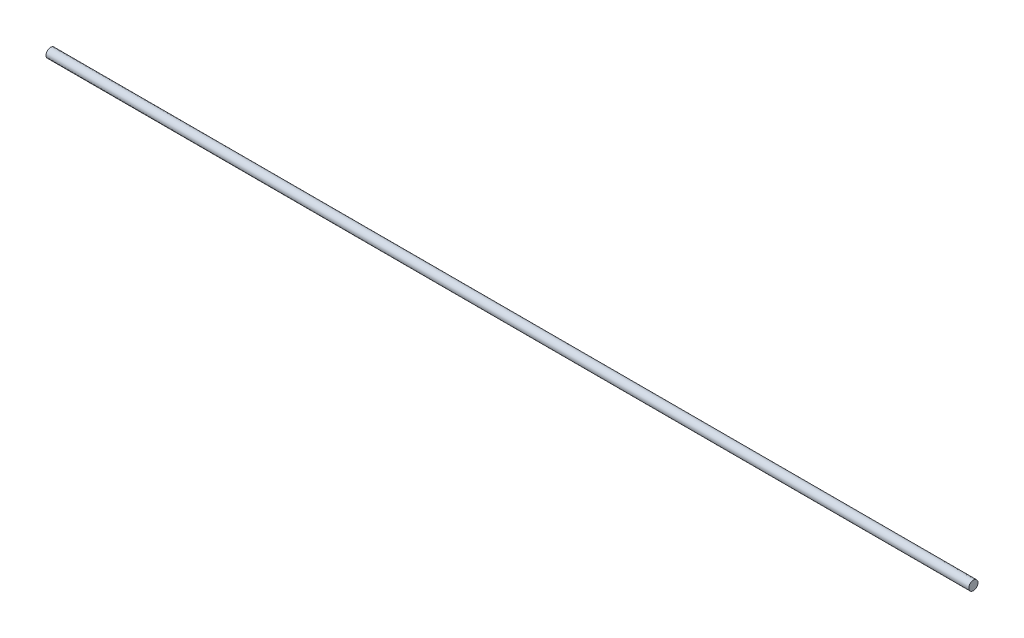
ISO-10303-21;
HEADER;
FILE_DESCRIPTION(('STEP AP214'),'2;1');
FILE_NAME('part.step','',(''),(''),'','','');
FILE_SCHEMA(('AUTOMOTIVE_DESIGN { 1 0 10303 214 1 1 1 1 }'));
ENDSEC;
DATA;
#1=APPLICATION_CONTEXT('core data for automotive mechanical design processes');
#2=APPLICATION_PROTOCOL_DEFINITION('international standard','automotive_design',2000,#1);
#3=PRODUCT_CONTEXT('',#1,'mechanical');
#4=PRODUCT('Part','Part','',(#3));
#5=PRODUCT_RELATED_PRODUCT_CATEGORY('part','',(#4));
#6=PRODUCT_DEFINITION_FORMATION('','',#4);
#7=PRODUCT_DEFINITION_CONTEXT('part definition',#1,'design');
#8=PRODUCT_DEFINITION('design','',#6,#7);
#9=PRODUCT_DEFINITION_SHAPE('','',#8);
#10=(LENGTH_UNIT() NAMED_UNIT(*) SI_UNIT(.MILLI.,.METRE.));
#11=(NAMED_UNIT(*) PLANE_ANGLE_UNIT() SI_UNIT($,.RADIAN.));
#12=(NAMED_UNIT(*) SI_UNIT($,.STERADIAN.) SOLID_ANGLE_UNIT());
#13=UNCERTAINTY_MEASURE_WITH_UNIT(LENGTH_MEASURE(1.E-05),#10,'distance_accuracy_value','');
#14=(GEOMETRIC_REPRESENTATION_CONTEXT(3) GLOBAL_UNCERTAINTY_ASSIGNED_CONTEXT((#13)) GLOBAL_UNIT_ASSIGNED_CONTEXT((#10,
#11,#12)) REPRESENTATION_CONTEXT('',''));
#15=CARTESIAN_POINT('',(0.,0.,0.));
#16=DIRECTION('',(0.,0.,1.));
#17=DIRECTION('',(1.,0.,0.));
#18=AXIS2_PLACEMENT_3D('',#15,#16,#17);
#19=CARTESIAN_POINT('',(85.,0.,0.));
#20=DIRECTION('',(-1.,0.,0.));
#21=DIRECTION('',(0.,0.,1.));
#22=AXIS2_PLACEMENT_3D('',#19,#20,#21);
#23=CYLINDRICAL_SURFACE('',#22,0.425);
#24=CARTESIAN_POINT('',(85.,0.,0.));
#25=DIRECTION('',(1.,0.,0.));
#26=DIRECTION('',(0.,0.,-1.));
#27=AXIS2_PLACEMENT_3D('',#24,#25,#26);
#28=CIRCLE('',#27,0.425);
#29=CARTESIAN_POINT('',(85.,0.,-0.425));
#30=VERTEX_POINT('',#29);
#31=EDGE_CURVE('E10',#30,#30,#28,.T.);
#32=ORIENTED_EDGE('',*,*,#31,.F.);
#33=EDGE_LOOP('',(#32));
#34=FACE_BOUND('',#33,.T.);
#35=CARTESIAN_POINT('',(0.,0.,0.));
#36=DIRECTION('',(1.,0.,0.));
#37=DIRECTION('',(0.,0.,-1.));
#38=AXIS2_PLACEMENT_3D('',#35,#36,#37);
#39=CIRCLE('',#38,0.425);
#40=CARTESIAN_POINT('',(0.,0.,-0.425));
#41=VERTEX_POINT('',#40);
#42=EDGE_CURVE('E30',#41,#41,#39,.T.);
#43=ORIENTED_EDGE('',*,*,#42,.T.);
#44=EDGE_LOOP('',(#43));
#45=FACE_BOUND('',#44,.T.);
#46=ADVANCED_FACE('F24',(#34,#45),#23,.T.);
#47=CARTESIAN_POINT('',(85.,0.,0.));
#48=DIRECTION('',(1.,0.,0.));
#49=DIRECTION('',(0.,0.,-1.));
#50=AXIS2_PLACEMENT_3D('',#47,#48,#49);
#51=PLANE('',#50);
#52=ORIENTED_EDGE('',*,*,#31,.T.);
#53=EDGE_LOOP('',(#52));
#54=FACE_BOUND('',#53,.T.);
#55=ADVANCED_FACE('F39',(#54),#51,.T.);
#56=CARTESIAN_POINT('',(0.,0.,0.));
#57=DIRECTION('',(1.,0.,0.));
#58=DIRECTION('',(0.,0.,-1.));
#59=AXIS2_PLACEMENT_3D('',#56,#57,#58);
#60=PLANE('',#59);
#61=ORIENTED_EDGE('',*,*,#42,.F.);
#62=EDGE_LOOP('',(#61));
#63=FACE_BOUND('',#62,.T.);
#64=ADVANCED_FACE('F37',(#63),#60,.F.);
#65=CLOSED_SHELL('',(#46,#55,#64));
#66=MANIFOLD_SOLID_BREP('B2',#65);
#67=ADVANCED_BREP_SHAPE_REPRESENTATION('',(#18,#66),#14);
#68=SHAPE_DEFINITION_REPRESENTATION(#9,#67);
ENDSEC;
END-ISO-10303-21;
